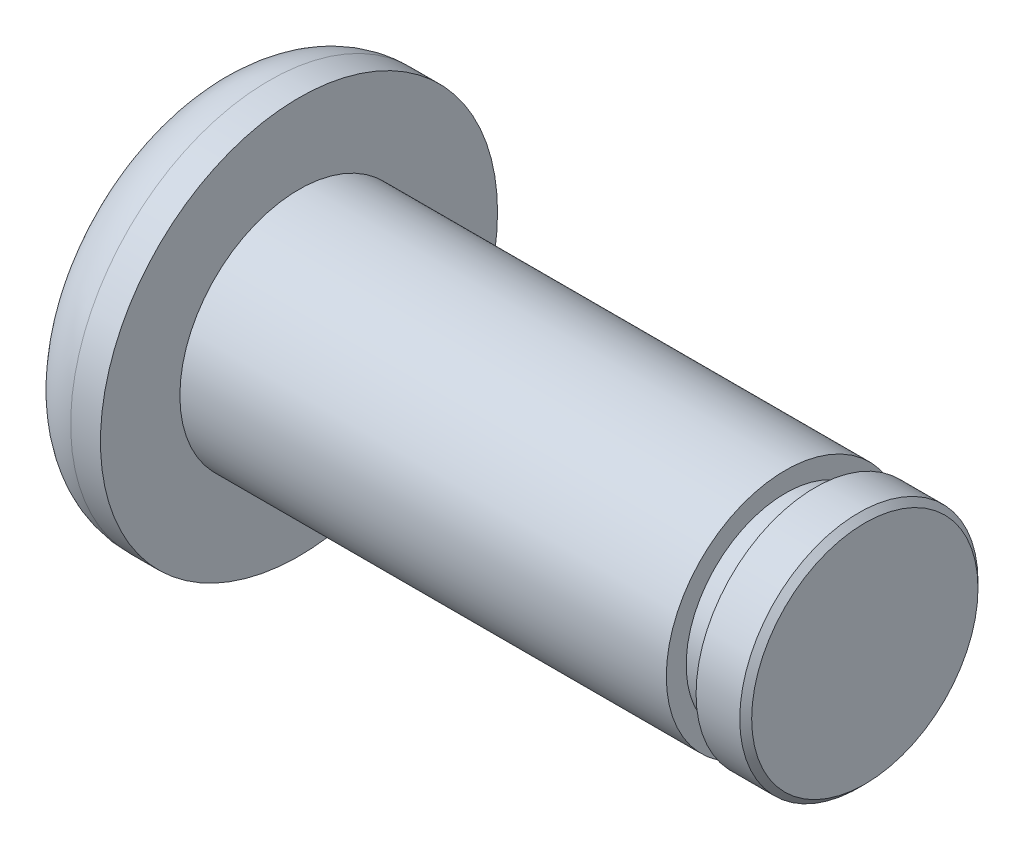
ISO-10303-21;
HEADER;
FILE_DESCRIPTION(('STEP AP214'),'2;1');
FILE_NAME('part.step','',(''),(''),'','','');
FILE_SCHEMA(('AUTOMOTIVE_DESIGN { 1 0 10303 214 1 1 1 1 }'));
ENDSEC;
DATA;
#1=APPLICATION_CONTEXT('core data for automotive mechanical design processes');
#2=APPLICATION_PROTOCOL_DEFINITION('international standard','automotive_design',2000,#1);
#3=PRODUCT_CONTEXT('',#1,'mechanical');
#4=PRODUCT('Part','Part','',(#3));
#5=PRODUCT_RELATED_PRODUCT_CATEGORY('part','',(#4));
#6=PRODUCT_DEFINITION_FORMATION('','',#4);
#7=PRODUCT_DEFINITION_CONTEXT('part definition',#1,'design');
#8=PRODUCT_DEFINITION('design','',#6,#7);
#9=PRODUCT_DEFINITION_SHAPE('','',#8);
#10=(LENGTH_UNIT() NAMED_UNIT(*) SI_UNIT(.MILLI.,.METRE.));
#11=(NAMED_UNIT(*) PLANE_ANGLE_UNIT() SI_UNIT($,.RADIAN.));
#12=(NAMED_UNIT(*) SI_UNIT($,.STERADIAN.) SOLID_ANGLE_UNIT());
#13=UNCERTAINTY_MEASURE_WITH_UNIT(LENGTH_MEASURE(1.E-05),#10,'distance_accuracy_value','');
#14=(GEOMETRIC_REPRESENTATION_CONTEXT(3) GLOBAL_UNCERTAINTY_ASSIGNED_CONTEXT((#13)) GLOBAL_UNIT_ASSIGNED_CONTEXT((#10,
#11,#12)) REPRESENTATION_CONTEXT('',''));
#15=CARTESIAN_POINT('',(0.,0.,0.));
#16=DIRECTION('',(0.,0.,1.));
#17=DIRECTION('',(1.,0.,0.));
#18=AXIS2_PLACEMENT_3D('',#15,#16,#17);
#19=CARTESIAN_POINT('',(28.5,0.,0.));
#20=DIRECTION('',(1.,0.,0.));
#21=DIRECTION('',(0.,0.,-1.));
#22=AXIS2_PLACEMENT_3D('',#19,#20,#21);
#23=PLANE('',#22);
#24=CARTESIAN_POINT('',(28.5,0.,0.));
#25=DIRECTION('',(1.,0.,0.));
#26=DIRECTION('',(0.,0.,-1.));
#27=AXIS2_PLACEMENT_3D('',#24,#25,#26);
#28=CIRCLE('',#27,5.69999999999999);
#29=CARTESIAN_POINT('',(28.5,0.,-5.69999999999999));
#30=VERTEX_POINT('',#29);
#31=EDGE_CURVE('E41',#30,#30,#28,.T.);
#32=ORIENTED_EDGE('',*,*,#31,.T.);
#33=EDGE_LOOP('',(#32));
#34=FACE_BOUND('',#33,.T.);
#35=ADVANCED_FACE('F35',(#34),#23,.T.);
#36=CARTESIAN_POINT('',(0.,0.,0.));
#37=DIRECTION('',(1.,0.,0.));
#38=DIRECTION('',(0.,0.,-1.));
#39=AXIS2_PLACEMENT_3D('',#36,#37,#38);
#40=CYLINDRICAL_SURFACE('',#39,6.);
#41=CARTESIAN_POINT('',(28.2,0.,0.));
#42=DIRECTION('',(1.,0.,0.));
#43=DIRECTION('',(0.,0.,-1.));
#44=AXIS2_PLACEMENT_3D('',#41,#42,#43);
#45=CIRCLE('',#44,6.);
#46=CARTESIAN_POINT('',(28.2,0.,-6.));
#47=VERTEX_POINT('',#46);
#48=EDGE_CURVE('E10',#47,#47,#45,.F.);
#49=ORIENTED_EDGE('',*,*,#48,.T.);
#50=EDGE_LOOP('',(#49));
#51=FACE_BOUND('',#50,.T.);
#52=CARTESIAN_POINT('',(26.,0.,0.));
#53=DIRECTION('',(1.,0.,0.));
#54=DIRECTION('',(0.,0.,-1.));
#55=AXIS2_PLACEMENT_3D('',#52,#53,#54);
#56=CIRCLE('',#55,6.);
#57=CARTESIAN_POINT('',(26.,0.,-6.));
#58=VERTEX_POINT('',#57);
#59=EDGE_CURVE('E45',#58,#58,#56,.T.);
#60=ORIENTED_EDGE('',*,*,#59,.T.);
#61=EDGE_LOOP('',(#60));
#62=FACE_BOUND('',#61,.T.);
#63=ADVANCED_FACE('F89',(#51,#62),#40,.T.);
#64=CARTESIAN_POINT('',(26.,6.,0.));
#65=DIRECTION('',(-1.,0.,0.));
#66=DIRECTION('',(0.,0.,1.));
#67=AXIS2_PLACEMENT_3D('',#64,#65,#66);
#68=PLANE('',#67);
#69=CARTESIAN_POINT('',(26.,0.,0.));
#70=DIRECTION('',(1.,0.,0.));
#71=DIRECTION('',(0.,0.,-1.));
#72=AXIS2_PLACEMENT_3D('',#69,#70,#71);
#73=CIRCLE('',#72,5.);
#74=CARTESIAN_POINT('',(26.,0.,-5.));
#75=VERTEX_POINT('',#74);
#76=EDGE_CURVE('E49',#75,#75,#73,.T.);
#77=ORIENTED_EDGE('',*,*,#76,.T.);
#78=EDGE_LOOP('',(#77));
#79=FACE_BOUND('',#78,.T.);
#80=ORIENTED_EDGE('',*,*,#59,.F.);
#81=EDGE_LOOP('',(#80));
#82=FACE_BOUND('',#81,.T.);
#83=ADVANCED_FACE('F93',(#79,#82),#68,.T.);
#84=CARTESIAN_POINT('',(0.,0.,0.));
#85=DIRECTION('',(1.,0.,0.));
#86=DIRECTION('',(0.,0.,-1.));
#87=AXIS2_PLACEMENT_3D('',#84,#85,#86);
#88=CYLINDRICAL_SURFACE('',#87,5.);
#89=CARTESIAN_POINT('',(24.5,0.,0.));
#90=DIRECTION('',(1.,0.,0.));
#91=DIRECTION('',(0.,0.,-1.));
#92=AXIS2_PLACEMENT_3D('',#89,#90,#91);
#93=CIRCLE('',#92,5.);
#94=CARTESIAN_POINT('',(24.5,0.,-5.));
#95=VERTEX_POINT('',#94);
#96=EDGE_CURVE('E54',#95,#95,#93,.T.);
#97=ORIENTED_EDGE('',*,*,#96,.T.);
#98=EDGE_LOOP('',(#97));
#99=FACE_BOUND('',#98,.T.);
#100=ORIENTED_EDGE('',*,*,#76,.F.);
#101=EDGE_LOOP('',(#100));
#102=FACE_BOUND('',#101,.T.);
#103=ADVANCED_FACE('F97',(#99,#102),#88,.T.);
#104=CARTESIAN_POINT('',(24.5,5.,0.));
#105=DIRECTION('',(1.,0.,0.));
#106=DIRECTION('',(0.,0.,-1.));
#107=AXIS2_PLACEMENT_3D('',#104,#105,#106);
#108=PLANE('',#107);
#109=CARTESIAN_POINT('',(24.5,0.,0.));
#110=DIRECTION('',(1.,0.,0.));
#111=DIRECTION('',(0.,0.,-1.));
#112=AXIS2_PLACEMENT_3D('',#109,#110,#111);
#113=CIRCLE('',#112,6.);
#114=CARTESIAN_POINT('',(24.5,0.,-6.));
#115=VERTEX_POINT('',#114);
#116=EDGE_CURVE('E57',#115,#115,#113,.T.);
#117=ORIENTED_EDGE('',*,*,#116,.T.);
#118=EDGE_LOOP('',(#117));
#119=FACE_BOUND('',#118,.T.);
#120=ORIENTED_EDGE('',*,*,#96,.F.);
#121=EDGE_LOOP('',(#120));
#122=FACE_BOUND('',#121,.T.);
#123=ADVANCED_FACE('F104',(#119,#122),#108,.T.);
#124=CARTESIAN_POINT('',(0.,0.,0.));
#125=DIRECTION('',(1.,0.,0.));
#126=DIRECTION('',(0.,0.,-1.));
#127=AXIS2_PLACEMENT_3D('',#124,#125,#126);
#128=CYLINDRICAL_SURFACE('',#127,6.);
#129=CARTESIAN_POINT('',(0.,0.,0.));
#130=DIRECTION('',(1.,0.,0.));
#131=DIRECTION('',(0.,0.,-1.));
#132=AXIS2_PLACEMENT_3D('',#129,#130,#131);
#133=CIRCLE('',#132,5.99999999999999);
#134=CARTESIAN_POINT('',(0.,0.,-5.99999999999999));
#135=VERTEX_POINT('',#134);
#136=EDGE_CURVE('E60',#135,#135,#133,.T.);
#137=ORIENTED_EDGE('',*,*,#136,.T.);
#138=EDGE_LOOP('',(#137));
#139=FACE_BOUND('',#138,.T.);
#140=ORIENTED_EDGE('',*,*,#116,.F.);
#141=EDGE_LOOP('',(#140));
#142=FACE_BOUND('',#141,.T.);
#143=ADVANCED_FACE('F108',(#139,#142),#128,.T.);
#144=CARTESIAN_POINT('',(0.,5.99999999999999,0.));
#145=DIRECTION('',(1.,0.,0.));
#146=DIRECTION('',(0.,0.,-1.));
#147=AXIS2_PLACEMENT_3D('',#144,#145,#146);
#148=PLANE('',#147);
#149=CARTESIAN_POINT('',(0.,0.,0.));
#150=DIRECTION('',(1.,0.,0.));
#151=DIRECTION('',(0.,0.,-1.));
#152=AXIS2_PLACEMENT_3D('',#149,#150,#151);
#153=CIRCLE('',#152,10.);
#154=CARTESIAN_POINT('',(0.,0.,-10.));
#155=VERTEX_POINT('',#154);
#156=EDGE_CURVE('E63',#155,#155,#153,.T.);
#157=ORIENTED_EDGE('',*,*,#156,.T.);
#158=EDGE_LOOP('',(#157));
#159=FACE_BOUND('',#158,.T.);
#160=ORIENTED_EDGE('',*,*,#136,.F.);
#161=EDGE_LOOP('',(#160));
#162=FACE_BOUND('',#161,.T.);
#163=ADVANCED_FACE('F112',(#159,#162),#148,.T.);
#164=CARTESIAN_POINT('',(0.,0.,0.));
#165=DIRECTION('',(1.,0.,0.));
#166=DIRECTION('',(0.,0.,-1.));
#167=AXIS2_PLACEMENT_3D('',#164,#165,#166);
#168=CYLINDRICAL_SURFACE('',#167,10.);
#169=CARTESIAN_POINT('',(-1.49999999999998,0.,0.));
#170=DIRECTION('',(1.,0.,0.));
#171=DIRECTION('',(0.,0.,-1.));
#172=AXIS2_PLACEMENT_3D('',#169,#170,#171);
#173=CIRCLE('',#172,10.);
#174=CARTESIAN_POINT('',(-1.49999999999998,0.,-10.));
#175=VERTEX_POINT('',#174);
#176=EDGE_CURVE('E66',#175,#175,#173,.T.);
#177=ORIENTED_EDGE('',*,*,#176,.T.);
#178=EDGE_LOOP('',(#177));
#179=FACE_BOUND('',#178,.T.);
#180=ORIENTED_EDGE('',*,*,#156,.F.);
#181=EDGE_LOOP('',(#180));
#182=FACE_BOUND('',#181,.T.);
#183=ADVANCED_FACE('F86',(#179,#182),#168,.T.);
#184=CARTESIAN_POINT('',(-1.5,0.,0.));
#185=DIRECTION('',(1.,0.,0.));
#186=DIRECTION('',(0.,0.,-1.));
#187=AXIS2_PLACEMENT_3D('',#184,#185,#186);
#188=TOROIDAL_SURFACE('',#187,7.,3.);
#189=CARTESIAN_POINT('',(-4.5,0.,0.));
#190=DIRECTION('',(1.,0.,0.));
#191=DIRECTION('',(0.,0.,-1.));
#192=AXIS2_PLACEMENT_3D('',#189,#190,#191);
#193=CIRCLE('',#192,6.99999999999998);
#194=CARTESIAN_POINT('',(-4.5,0.,-6.99999999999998));
#195=VERTEX_POINT('',#194);
#196=EDGE_CURVE('E69',#195,#195,#193,.T.);
#197=ORIENTED_EDGE('',*,*,#196,.T.);
#198=EDGE_LOOP('',(#197));
#199=FACE_BOUND('',#198,.T.);
#200=ORIENTED_EDGE('',*,*,#176,.F.);
#201=EDGE_LOOP('',(#200));
#202=FACE_BOUND('',#201,.T.);
#203=ADVANCED_FACE('F73',(#199,#202),#188,.T.);
#204=CARTESIAN_POINT('',(-4.5,6.99999999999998,0.));
#205=DIRECTION('',(-1.,0.,0.));
#206=DIRECTION('',(0.,0.,1.));
#207=AXIS2_PLACEMENT_3D('',#204,#205,#206);
#208=PLANE('',#207);
#209=ORIENTED_EDGE('',*,*,#196,.F.);
#210=EDGE_LOOP('',(#209));
#211=FACE_BOUND('',#210,.T.);
#212=ADVANCED_FACE('F76',(#211),#208,.T.);
#213=CARTESIAN_POINT('',(28.5,0.,0.));
#214=DIRECTION('',(-1.,0.,0.));
#215=DIRECTION('',(0.,0.,1.));
#216=AXIS2_PLACEMENT_3D('',#213,#214,#215);
#217=CONICAL_SURFACE('',#216,5.69999999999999,0.785398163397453);
#218=ORIENTED_EDGE('',*,*,#48,.F.);
#219=EDGE_LOOP('',(#218));
#220=FACE_BOUND('',#219,.T.);
#221=ORIENTED_EDGE('',*,*,#31,.F.);
#222=EDGE_LOOP('',(#221));
#223=FACE_BOUND('',#222,.T.);
#224=ADVANCED_FACE('F78',(#220,#223),#217,.T.);
#225=CLOSED_SHELL('',(#35,#63,#83,#103,#123,#143,#163,#183,#203,#212,#224));
#226=MANIFOLD_SOLID_BREP('B2',#225);
#227=ADVANCED_BREP_SHAPE_REPRESENTATION('',(#18,#226),#14);
#228=SHAPE_DEFINITION_REPRESENTATION(#9,#227);
ENDSEC;
END-ISO-10303-21;
